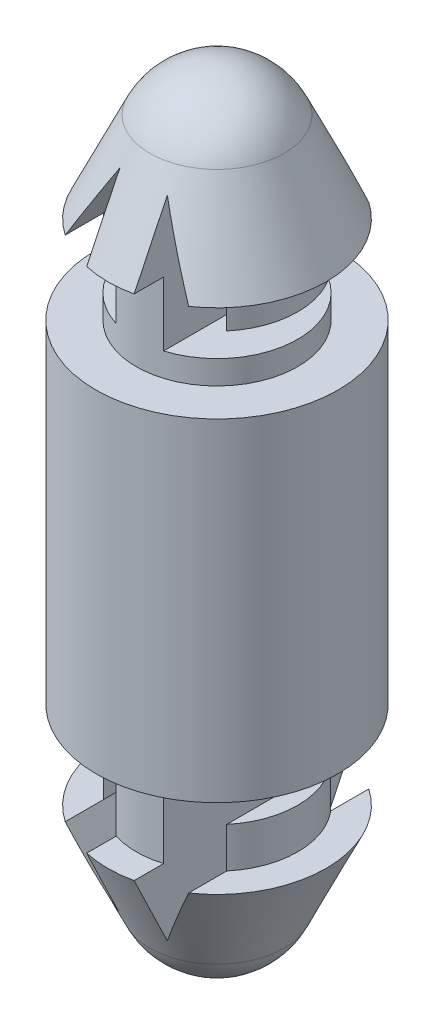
from build123d import *

# Parameters (mm, degrees)
CUT_EXTRUDE_1_DEPTH      = 13.195388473
CUT_EXTRUDE_1_DEPTH_BACK = 13.195388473


with BuildPart() as part:
    # Sketch 1 → Revolve 1 (revolve)
    with BuildSketch(Plane.XY, mode=Mode.PRIVATE) as revolve_1_sk:
        with BuildLine():
            Line((1.7, -1.85), (2.3, -1.85))
            Line((2.3, -1.85), (1.41456419, -3.748823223))
            ThreePointArc((1.41456419, -3.748823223), (0.838616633, -4.405565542), (0, -4.65))
            Line((0, -4.65), (0, 11.65))
            ThreePointArc((0, 11.65), (0.838616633, 11.405565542), (1.41456419, 10.748823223))
            Line((1.41456419, 10.748823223), (2.3, 8.85))
            Line((2.3, 8.85), (1.7, 8.85))
            Line((1.7, 8.85), (1.7, 7))
            Line((1.7, 7), (2.55, 7))
            Line((2.55, 7), (2.55, 0))
            Line((2.55, 0), (1.7, 0))
            Line((1.7, 0), (1.7, -1.85))
        make_face()
    revolve(revolve_1_sk.sketch.rotate(Axis((0, -4.65, 0), (0, 1, 0)), 90), axis=Axis((0, -4.65, 0), (0, 1, 0)))

    # Sketch 2 → Cut-Extrude 1 (cut, two sides: drawn at the far end of the back side and taken through both)
    with BuildSketch(Plane.XY.offset(-CUT_EXTRUDE_1_DEPTH_BACK)):
        Polygon((-2.55, -0.5), (-0.5, -0.5), (-0.5, -3.3), (-1.3, -1.85), (-1.3, -1), (-2.55, -1), align=None)
        Polygon((2.55, -1), (2.55, -0.5), (0.5, -0.5), (0.5, -3.3), (1.3, -1.85), (1.3, -1), align=None)
        Polygon((2.55, 7.5), (0.5, 7.5), (0.5, 10.3), (1.3, 8.85), (1.3, 8), (2.55, 8), align=None)
        Polygon((-2.55, 8), (-2.55, 7.5), (-0.5, 7.5), (-0.5, 10.3), (-1.3, 8.85), (-1.3, 8), align=None)
    extrude(amount=CUT_EXTRUDE_1_DEPTH + CUT_EXTRUDE_1_DEPTH_BACK, mode=Mode.SUBTRACT)


solid = part.part
